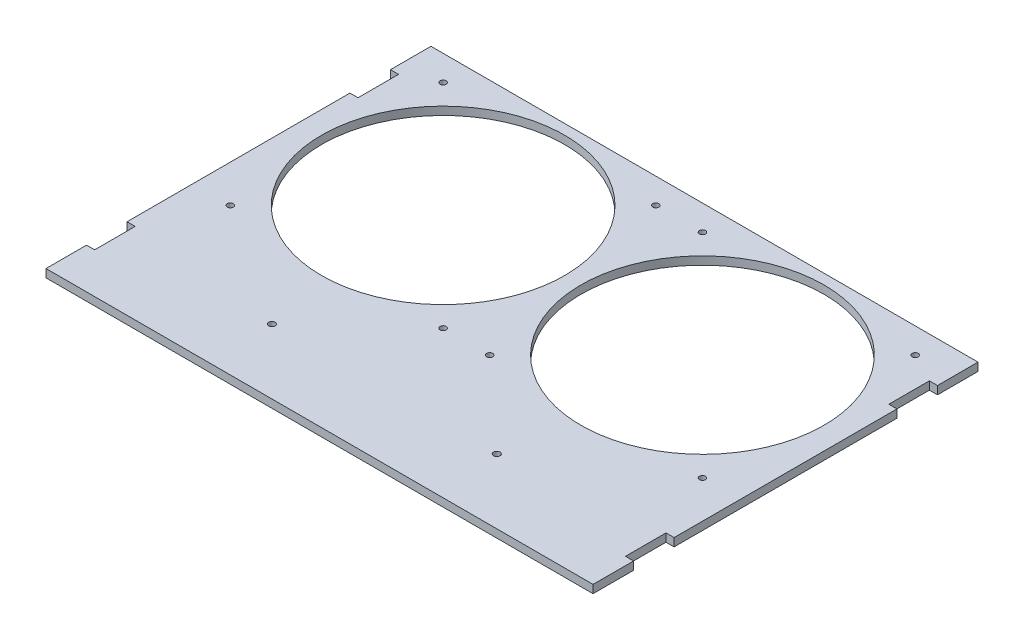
ISO-10303-21;
HEADER;
FILE_DESCRIPTION(('STEP AP214'),'2;1');
FILE_NAME('part.step','',(''),(''),'','','');
FILE_SCHEMA(('AUTOMOTIVE_DESIGN { 1 0 10303 214 1 1 1 1 }'));
ENDSEC;
DATA;
#1=APPLICATION_CONTEXT('core data for automotive mechanical design processes');
#2=APPLICATION_PROTOCOL_DEFINITION('international standard','automotive_design',2000,#1);
#3=PRODUCT_CONTEXT('',#1,'mechanical');
#4=PRODUCT('Part','Part','',(#3));
#5=PRODUCT_RELATED_PRODUCT_CATEGORY('part','',(#4));
#6=PRODUCT_DEFINITION_FORMATION('','',#4);
#7=PRODUCT_DEFINITION_CONTEXT('part definition',#1,'design');
#8=PRODUCT_DEFINITION('design','',#6,#7);
#9=PRODUCT_DEFINITION_SHAPE('','',#8);
#10=(LENGTH_UNIT() NAMED_UNIT(*) SI_UNIT(.MILLI.,.METRE.));
#11=(NAMED_UNIT(*) PLANE_ANGLE_UNIT() SI_UNIT($,.RADIAN.));
#12=(NAMED_UNIT(*) SI_UNIT($,.STERADIAN.) SOLID_ANGLE_UNIT());
#13=UNCERTAINTY_MEASURE_WITH_UNIT(LENGTH_MEASURE(1.E-05),#10,'distance_accuracy_value','');
#14=(GEOMETRIC_REPRESENTATION_CONTEXT(3) GLOBAL_UNCERTAINTY_ASSIGNED_CONTEXT((#13)) GLOBAL_UNIT_ASSIGNED_CONTEXT((#10,
#11,#12)) REPRESENTATION_CONTEXT('',''));
#15=CARTESIAN_POINT('',(0.,0.,0.));
#16=DIRECTION('',(0.,0.,1.));
#17=DIRECTION('',(1.,0.,0.));
#18=AXIS2_PLACEMENT_3D('',#15,#16,#17);
#19=CARTESIAN_POINT('',(0.,4.,0.));
#20=DIRECTION('',(0.,1.,0.));
#21=DIRECTION('',(0.,0.,1.));
#22=AXIS2_PLACEMENT_3D('',#19,#20,#21);
#23=PLANE('',#22);
#24=CARTESIAN_POINT('',(-55.5,4.,93.));
#25=DIRECTION('',(0.,1.,0.));
#26=DIRECTION('',(0.,0.,1.));
#27=AXIS2_PLACEMENT_3D('',#24,#25,#26);
#28=CIRCLE('',#27,1.60000000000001);
#29=CARTESIAN_POINT('',(-55.5,4.,94.6));
#30=VERTEX_POINT('',#29);
#31=EDGE_CURVE('E428',#30,#30,#28,.T.);
#32=ORIENTED_EDGE('',*,*,#31,.F.);
#33=EDGE_LOOP('',(#32));
#34=FACE_BOUND('',#33,.T.);
#35=CARTESIAN_POINT('',(116.5,4.,-52.5));
#36=DIRECTION('',(0.,1.,0.));
#37=DIRECTION('',(0.,0.,-1.));
#38=AXIS2_PLACEMENT_3D('',#35,#36,#37);
#39=CIRCLE('',#38,1.5);
#40=CARTESIAN_POINT('',(116.5,4.,-54.));
#41=VERTEX_POINT('',#40);
#42=EDGE_CURVE('E440',#41,#41,#39,.T.);
#43=ORIENTED_EDGE('',*,*,#42,.F.);
#44=EDGE_LOOP('',(#43));
#45=FACE_BOUND('',#44,.T.);
#46=CARTESIAN_POINT('',(11.5,4.,52.5000000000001));
#47=DIRECTION('',(0.,1.,0.));
#48=DIRECTION('',(0.,0.,-1.));
#49=AXIS2_PLACEMENT_3D('',#46,#47,#48);
#50=CIRCLE('',#49,1.5);
#51=CARTESIAN_POINT('',(11.5,4.,51.0000000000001));
#52=VERTEX_POINT('',#51);
#53=EDGE_CURVE('E452',#52,#52,#50,.T.);
#54=ORIENTED_EDGE('',*,*,#53,.F.);
#55=EDGE_LOOP('',(#54));
#56=FACE_BOUND('',#55,.T.);
#57=CARTESIAN_POINT('',(-11.5,4.,52.5000000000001));
#58=DIRECTION('',(0.,1.,0.));
#59=DIRECTION('',(0.,0.,1.));
#60=AXIS2_PLACEMENT_3D('',#57,#58,#59);
#61=CIRCLE('',#60,1.5);
#62=CARTESIAN_POINT('',(-11.5,4.,54.0000000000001));
#63=VERTEX_POINT('',#62);
#64=EDGE_CURVE('E464',#63,#63,#61,.T.);
#65=ORIENTED_EDGE('',*,*,#64,.F.);
#66=EDGE_LOOP('',(#65));
#67=FACE_BOUND('',#66,.T.);
#68=CARTESIAN_POINT('',(-11.5,4.,-52.5000000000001));
#69=DIRECTION('',(0.,1.,0.));
#70=DIRECTION('',(0.,0.,-1.));
#71=AXIS2_PLACEMENT_3D('',#68,#69,#70);
#72=CIRCLE('',#71,1.5);
#73=CARTESIAN_POINT('',(-11.5,4.,-54.0000000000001));
#74=VERTEX_POINT('',#73);
#75=EDGE_CURVE('E476',#74,#74,#72,.T.);
#76=ORIENTED_EDGE('',*,*,#75,.F.);
#77=EDGE_LOOP('',(#76));
#78=FACE_BOUND('',#77,.T.);
#79=CARTESIAN_POINT('',(-64.,4.,0.));
#80=DIRECTION('',(0.,1.,0.));
#81=DIRECTION('',(0.,0.,1.));
#82=AXIS2_PLACEMENT_3D('',#79,#80,#81);
#83=CIRCLE('',#82,60.);
#84=CARTESIAN_POINT('',(-64.,4.,60.));
#85=VERTEX_POINT('',#84);
#86=EDGE_CURVE('E206',#85,#85,#83,.T.);
#87=ORIENTED_EDGE('',*,*,#86,.F.);
#88=EDGE_LOOP('',(#87));
#89=FACE_BOUND('',#88,.T.);
#90=DIRECTION('',(0.,0.,1.));
#91=VECTOR('',#90,1.);
#92=CARTESIAN_POINT('',(-135.,4.,-65.));
#93=LINE('',#92,#91);
#94=CARTESIAN_POINT('',(-135.,4.,-65.));
#95=VERTEX_POINT('',#94);
#96=CARTESIAN_POINT('',(-135.,4.,-45.));
#97=VERTEX_POINT('',#96);
#98=EDGE_CURVE('E241',#95,#97,#93,.T.);
#99=ORIENTED_EDGE('',*,*,#98,.T.);
#100=DIRECTION('',(1.,0.,0.));
#101=VECTOR('',#100,1.);
#102=CARTESIAN_POINT('',(-135.,4.,-45.));
#103=LINE('',#102,#101);
#104=CARTESIAN_POINT('',(-131.,4.,-45.));
#105=VERTEX_POINT('',#104);
#106=EDGE_CURVE('E129',#97,#105,#103,.T.);
#107=ORIENTED_EDGE('',*,*,#106,.T.);
#108=DIRECTION('',(0.,0.,1.));
#109=VECTOR('',#108,1.);
#110=CARTESIAN_POINT('',(-131.,4.,-45.));
#111=LINE('',#110,#109);
#112=CARTESIAN_POINT('',(-131.,4.,-25.));
#113=VERTEX_POINT('',#112);
#114=EDGE_CURVE('E292',#105,#113,#111,.T.);
#115=ORIENTED_EDGE('',*,*,#114,.T.);
#116=DIRECTION('',(-1.,0.,0.));
#117=VECTOR('',#116,1.);
#118=CARTESIAN_POINT('',(-135.,4.,-25.));
#119=LINE('',#118,#117);
#120=CARTESIAN_POINT('',(-135.,4.,-25.));
#121=VERTEX_POINT('',#120);
#122=EDGE_CURVE('E311',#113,#121,#119,.T.);
#123=ORIENTED_EDGE('',*,*,#122,.T.);
#124=DIRECTION('',(0.,0.,1.));
#125=VECTOR('',#124,1.);
#126=CARTESIAN_POINT('',(-135.,4.,-25.));
#127=LINE('',#126,#125);
#128=CARTESIAN_POINT('',(-135.,4.,85.));
#129=VERTEX_POINT('',#128);
#130=EDGE_CURVE('E308',#121,#129,#127,.T.);
#131=ORIENTED_EDGE('',*,*,#130,.T.);
#132=DIRECTION('',(1.,0.,0.));
#133=VECTOR('',#132,1.);
#134=CARTESIAN_POINT('',(-135.,4.,85.));
#135=LINE('',#134,#133);
#136=CARTESIAN_POINT('',(-131.,4.,85.));
#137=VERTEX_POINT('',#136);
#138=EDGE_CURVE('E310',#129,#137,#135,.T.);
#139=ORIENTED_EDGE('',*,*,#138,.T.);
#140=DIRECTION('',(0.,0.,1.));
#141=VECTOR('',#140,1.);
#142=CARTESIAN_POINT('',(-131.,4.,85.));
#143=LINE('',#142,#141);
#144=CARTESIAN_POINT('',(-131.,4.,105.));
#145=VERTEX_POINT('',#144);
#146=EDGE_CURVE('E313',#137,#145,#143,.T.);
#147=ORIENTED_EDGE('',*,*,#146,.T.);
#148=DIRECTION('',(-1.,0.,0.));
#149=VECTOR('',#148,1.);
#150=CARTESIAN_POINT('',(-135.,4.,105.));
#151=LINE('',#150,#149);
#152=CARTESIAN_POINT('',(-135.,4.,105.));
#153=VERTEX_POINT('',#152);
#154=EDGE_CURVE('E319',#145,#153,#151,.T.);
#155=ORIENTED_EDGE('',*,*,#154,.T.);
#156=DIRECTION('',(0.,0.,1.));
#157=VECTOR('',#156,1.);
#158=CARTESIAN_POINT('',(-135.,4.,105.));
#159=LINE('',#158,#157);
#160=CARTESIAN_POINT('',(-135.,4.,125.));
#161=VERTEX_POINT('',#160);
#162=EDGE_CURVE('E321',#153,#161,#159,.T.);
#163=ORIENTED_EDGE('',*,*,#162,.T.);
#164=DIRECTION('',(1.,0.,0.));
#165=VECTOR('',#164,1.);
#166=CARTESIAN_POINT('',(-135.,4.,125.));
#167=LINE('',#166,#165);
#168=CARTESIAN_POINT('',(135.,4.,125.));
#169=VERTEX_POINT('',#168);
#170=EDGE_CURVE('E323',#161,#169,#167,.T.);
#171=ORIENTED_EDGE('',*,*,#170,.T.);
#172=DIRECTION('',(0.,0.,-1.));
#173=VECTOR('',#172,1.);
#174=CARTESIAN_POINT('',(135.,4.,105.));
#175=LINE('',#174,#173);
#176=CARTESIAN_POINT('',(135.,4.,105.));
#177=VERTEX_POINT('',#176);
#178=EDGE_CURVE('E325',#169,#177,#175,.T.);
#179=ORIENTED_EDGE('',*,*,#178,.T.);
#180=DIRECTION('',(-1.,0.,0.));
#181=VECTOR('',#180,1.);
#182=CARTESIAN_POINT('',(135.,4.,105.));
#183=LINE('',#182,#181);
#184=CARTESIAN_POINT('',(131.,4.,105.));
#185=VERTEX_POINT('',#184);
#186=EDGE_CURVE('E327',#177,#185,#183,.T.);
#187=ORIENTED_EDGE('',*,*,#186,.T.);
#188=DIRECTION('',(0.,0.,-1.));
#189=VECTOR('',#188,1.);
#190=CARTESIAN_POINT('',(131.,4.,85.));
#191=LINE('',#190,#189);
#192=CARTESIAN_POINT('',(131.,4.,85.));
#193=VERTEX_POINT('',#192);
#194=EDGE_CURVE('E329',#185,#193,#191,.T.);
#195=ORIENTED_EDGE('',*,*,#194,.T.);
#196=DIRECTION('',(1.,0.,0.));
#197=VECTOR('',#196,1.);
#198=CARTESIAN_POINT('',(135.,4.,85.));
#199=LINE('',#198,#197);
#200=CARTESIAN_POINT('',(135.,4.,85.));
#201=VERTEX_POINT('',#200);
#202=EDGE_CURVE('E331',#193,#201,#199,.T.);
#203=ORIENTED_EDGE('',*,*,#202,.T.);
#204=DIRECTION('',(0.,0.,-1.));
#205=VECTOR('',#204,1.);
#206=CARTESIAN_POINT('',(135.,4.,-25.));
#207=LINE('',#206,#205);
#208=CARTESIAN_POINT('',(135.,4.,-25.));
#209=VERTEX_POINT('',#208);
#210=EDGE_CURVE('E333',#201,#209,#207,.T.);
#211=ORIENTED_EDGE('',*,*,#210,.T.);
#212=DIRECTION('',(-1.,0.,0.));
#213=VECTOR('',#212,1.);
#214=CARTESIAN_POINT('',(135.,4.,-25.));
#215=LINE('',#214,#213);
#216=CARTESIAN_POINT('',(131.,4.,-25.));
#217=VERTEX_POINT('',#216);
#218=EDGE_CURVE('E335',#209,#217,#215,.T.);
#219=ORIENTED_EDGE('',*,*,#218,.T.);
#220=DIRECTION('',(0.,0.,-1.));
#221=VECTOR('',#220,1.);
#222=CARTESIAN_POINT('',(131.,4.,-45.));
#223=LINE('',#222,#221);
#224=CARTESIAN_POINT('',(131.,4.,-45.));
#225=VERTEX_POINT('',#224);
#226=EDGE_CURVE('E184',#217,#225,#223,.T.);
#227=ORIENTED_EDGE('',*,*,#226,.T.);
#228=DIRECTION('',(1.,0.,0.));
#229=VECTOR('',#228,1.);
#230=CARTESIAN_POINT('',(135.,4.,-45.));
#231=LINE('',#230,#229);
#232=CARTESIAN_POINT('',(135.,4.,-45.));
#233=VERTEX_POINT('',#232);
#234=EDGE_CURVE('E178',#225,#233,#231,.T.);
#235=ORIENTED_EDGE('',*,*,#234,.T.);
#236=DIRECTION('',(0.,0.,-1.));
#237=VECTOR('',#236,1.);
#238=CARTESIAN_POINT('',(135.,4.,-65.));
#239=LINE('',#238,#237);
#240=CARTESIAN_POINT('',(135.,4.,-65.));
#241=VERTEX_POINT('',#240);
#242=EDGE_CURVE('E182',#233,#241,#239,.T.);
#243=ORIENTED_EDGE('',*,*,#242,.T.);
#244=DIRECTION('',(-1.,0.,0.));
#245=VECTOR('',#244,1.);
#246=CARTESIAN_POINT('',(-135.,4.,-65.));
#247=LINE('',#246,#245);
#248=EDGE_CURVE('E50',#241,#95,#247,.T.);
#249=ORIENTED_EDGE('',*,*,#248,.T.);
#250=EDGE_LOOP('',(#99,#107,#115,#123,#131,#139,#147,#155,#163,#171,#179,#187,#195,#203,#211,
#219,#227,#235,#243,#249));
#251=FACE_BOUND('',#250,.T.);
#252=CARTESIAN_POINT('',(-116.5,4.,-52.5));
#253=DIRECTION('',(0.,1.,0.));
#254=DIRECTION('',(0.,0.,1.));
#255=AXIS2_PLACEMENT_3D('',#252,#253,#254);
#256=CIRCLE('',#255,1.5);
#257=CARTESIAN_POINT('',(-116.5,4.,-51.));
#258=VERTEX_POINT('',#257);
#259=EDGE_CURVE('E482',#258,#258,#256,.T.);
#260=ORIENTED_EDGE('',*,*,#259,.F.);
#261=EDGE_LOOP('',(#260));
#262=FACE_BOUND('',#261,.T.);
#263=CARTESIAN_POINT('',(-116.5,4.,52.5));
#264=DIRECTION('',(0.,1.,0.));
#265=DIRECTION('',(0.,0.,-1.));
#266=AXIS2_PLACEMENT_3D('',#263,#264,#265);
#267=CIRCLE('',#266,1.5);
#268=CARTESIAN_POINT('',(-116.5,4.,51.));
#269=VERTEX_POINT('',#268);
#270=EDGE_CURVE('E470',#269,#269,#267,.T.);
#271=ORIENTED_EDGE('',*,*,#270,.F.);
#272=EDGE_LOOP('',(#271));
#273=FACE_BOUND('',#272,.T.);
#274=CARTESIAN_POINT('',(116.5,4.,52.5000000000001));
#275=DIRECTION('',(0.,1.,0.));
#276=DIRECTION('',(0.,0.,1.));
#277=AXIS2_PLACEMENT_3D('',#274,#275,#276);
#278=CIRCLE('',#277,1.5);
#279=CARTESIAN_POINT('',(116.5,4.,54.0000000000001));
#280=VERTEX_POINT('',#279);
#281=EDGE_CURVE('E458',#280,#280,#278,.T.);
#282=ORIENTED_EDGE('',*,*,#281,.F.);
#283=EDGE_LOOP('',(#282));
#284=FACE_BOUND('',#283,.T.);
#285=CARTESIAN_POINT('',(11.5,4.,-52.5000000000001));
#286=DIRECTION('',(0.,1.,0.));
#287=DIRECTION('',(0.,0.,1.));
#288=AXIS2_PLACEMENT_3D('',#285,#286,#287);
#289=CIRCLE('',#288,1.5);
#290=CARTESIAN_POINT('',(11.5,4.,-51.0000000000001));
#291=VERTEX_POINT('',#290);
#292=EDGE_CURVE('E446',#291,#291,#289,.T.);
#293=ORIENTED_EDGE('',*,*,#292,.F.);
#294=EDGE_LOOP('',(#293));
#295=FACE_BOUND('',#294,.T.);
#296=CARTESIAN_POINT('',(64.,4.,0.));
#297=DIRECTION('',(0.,1.,0.));
#298=DIRECTION('',(0.,0.,-1.));
#299=AXIS2_PLACEMENT_3D('',#296,#297,#298);
#300=CIRCLE('',#299,60.);
#301=CARTESIAN_POINT('',(64.,4.,-60.0000000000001));
#302=VERTEX_POINT('',#301);
#303=EDGE_CURVE('E434',#302,#302,#300,.T.);
#304=ORIENTED_EDGE('',*,*,#303,.F.);
#305=EDGE_LOOP('',(#304));
#306=FACE_BOUND('',#305,.T.);
#307=CARTESIAN_POINT('',(55.5,4.,93.));
#308=DIRECTION('',(0.,1.,0.));
#309=DIRECTION('',(0.,0.,-1.));
#310=AXIS2_PLACEMENT_3D('',#307,#308,#309);
#311=CIRCLE('',#310,1.60000000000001);
#312=CARTESIAN_POINT('',(55.5,4.,91.4));
#313=VERTEX_POINT('',#312);
#314=EDGE_CURVE('E419',#313,#313,#311,.T.);
#315=ORIENTED_EDGE('',*,*,#314,.F.);
#316=EDGE_LOOP('',(#315));
#317=FACE_BOUND('',#316,.T.);
#318=ADVANCED_FACE('F33',(#34,#45,#56,#67,#78,#89,#251,#262,#273,#284,#295,#306,#317),#23,.T.);
#319=CARTESIAN_POINT('',(0.,0.,0.));
#320=DIRECTION('',(0.,1.,0.));
#321=DIRECTION('',(0.,0.,1.));
#322=AXIS2_PLACEMENT_3D('',#319,#320,#321);
#323=PLANE('',#322);
#324=CARTESIAN_POINT('',(-55.5,0.,93.));
#325=DIRECTION('',(0.,1.,0.));
#326=DIRECTION('',(0.,0.,1.));
#327=AXIS2_PLACEMENT_3D('',#324,#325,#326);
#328=CIRCLE('',#327,1.60000000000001);
#329=CARTESIAN_POINT('',(-55.5,0.,94.6));
#330=VERTEX_POINT('',#329);
#331=EDGE_CURVE('E425',#330,#330,#328,.T.);
#332=ORIENTED_EDGE('',*,*,#331,.T.);
#333=EDGE_LOOP('',(#332));
#334=FACE_BOUND('',#333,.T.);
#335=CARTESIAN_POINT('',(116.5,0.,-52.5));
#336=DIRECTION('',(0.,1.,0.));
#337=DIRECTION('',(0.,0.,-1.));
#338=AXIS2_PLACEMENT_3D('',#335,#336,#337);
#339=CIRCLE('',#338,1.5);
#340=CARTESIAN_POINT('',(116.5,0.,-54.));
#341=VERTEX_POINT('',#340);
#342=EDGE_CURVE('E437',#341,#341,#339,.T.);
#343=ORIENTED_EDGE('',*,*,#342,.T.);
#344=EDGE_LOOP('',(#343));
#345=FACE_BOUND('',#344,.T.);
#346=CARTESIAN_POINT('',(11.5,0.,52.5000000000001));
#347=DIRECTION('',(0.,1.,0.));
#348=DIRECTION('',(0.,0.,-1.));
#349=AXIS2_PLACEMENT_3D('',#346,#347,#348);
#350=CIRCLE('',#349,1.5);
#351=CARTESIAN_POINT('',(11.5,0.,51.0000000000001));
#352=VERTEX_POINT('',#351);
#353=EDGE_CURVE('E449',#352,#352,#350,.T.);
#354=ORIENTED_EDGE('',*,*,#353,.T.);
#355=EDGE_LOOP('',(#354));
#356=FACE_BOUND('',#355,.T.);
#357=CARTESIAN_POINT('',(-11.5,0.,52.5000000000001));
#358=DIRECTION('',(0.,1.,0.));
#359=DIRECTION('',(0.,0.,1.));
#360=AXIS2_PLACEMENT_3D('',#357,#358,#359);
#361=CIRCLE('',#360,1.5);
#362=CARTESIAN_POINT('',(-11.5,0.,54.0000000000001));
#363=VERTEX_POINT('',#362);
#364=EDGE_CURVE('E461',#363,#363,#361,.T.);
#365=ORIENTED_EDGE('',*,*,#364,.T.);
#366=EDGE_LOOP('',(#365));
#367=FACE_BOUND('',#366,.T.);
#368=CARTESIAN_POINT('',(-11.5,0.,-52.5000000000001));
#369=DIRECTION('',(0.,1.,0.));
#370=DIRECTION('',(0.,0.,-1.));
#371=AXIS2_PLACEMENT_3D('',#368,#369,#370);
#372=CIRCLE('',#371,1.5);
#373=CARTESIAN_POINT('',(-11.5,0.,-54.0000000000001));
#374=VERTEX_POINT('',#373);
#375=EDGE_CURVE('E473',#374,#374,#372,.T.);
#376=ORIENTED_EDGE('',*,*,#375,.T.);
#377=EDGE_LOOP('',(#376));
#378=FACE_BOUND('',#377,.T.);
#379=CARTESIAN_POINT('',(-64.,0.,0.));
#380=DIRECTION('',(0.,1.,0.));
#381=DIRECTION('',(0.,0.,1.));
#382=AXIS2_PLACEMENT_3D('',#379,#380,#381);
#383=CIRCLE('',#382,60.);
#384=CARTESIAN_POINT('',(-64.,0.,60.));
#385=VERTEX_POINT('',#384);
#386=EDGE_CURVE('E485',#385,#385,#383,.T.);
#387=ORIENTED_EDGE('',*,*,#386,.T.);
#388=EDGE_LOOP('',(#387));
#389=FACE_BOUND('',#388,.T.);
#390=DIRECTION('',(0.,0.,1.));
#391=VECTOR('',#390,1.);
#392=CARTESIAN_POINT('',(-135.,0.,-65.));
#393=LINE('',#392,#391);
#394=CARTESIAN_POINT('',(-135.,0.,-65.));
#395=VERTEX_POINT('',#394);
#396=CARTESIAN_POINT('',(-135.,0.,-45.));
#397=VERTEX_POINT('',#396);
#398=EDGE_CURVE('E202',#395,#397,#393,.T.);
#399=ORIENTED_EDGE('',*,*,#398,.F.);
#400=DIRECTION('',(-1.,0.,0.));
#401=VECTOR('',#400,1.);
#402=CARTESIAN_POINT('',(-135.,0.,-65.));
#403=LINE('',#402,#401);
#404=CARTESIAN_POINT('',(135.,0.,-65.));
#405=VERTEX_POINT('',#404);
#406=EDGE_CURVE('E121',#405,#395,#403,.T.);
#407=ORIENTED_EDGE('',*,*,#406,.F.);
#408=DIRECTION('',(0.,0.,-1.));
#409=VECTOR('',#408,1.);
#410=CARTESIAN_POINT('',(135.,0.,-65.));
#411=LINE('',#410,#409);
#412=CARTESIAN_POINT('',(135.,0.,-45.));
#413=VERTEX_POINT('',#412);
#414=EDGE_CURVE('E115',#413,#405,#411,.T.);
#415=ORIENTED_EDGE('',*,*,#414,.F.);
#416=DIRECTION('',(1.,0.,0.));
#417=VECTOR('',#416,1.);
#418=CARTESIAN_POINT('',(135.,0.,-45.));
#419=LINE('',#418,#417);
#420=CARTESIAN_POINT('',(131.,0.,-45.));
#421=VERTEX_POINT('',#420);
#422=EDGE_CURVE('E192',#421,#413,#419,.T.);
#423=ORIENTED_EDGE('',*,*,#422,.F.);
#424=DIRECTION('',(0.,0.,-1.));
#425=VECTOR('',#424,1.);
#426=CARTESIAN_POINT('',(131.,0.,-45.));
#427=LINE('',#426,#425);
#428=CARTESIAN_POINT('',(131.,0.,-25.));
#429=VERTEX_POINT('',#428);
#430=EDGE_CURVE('E236',#429,#421,#427,.T.);
#431=ORIENTED_EDGE('',*,*,#430,.F.);
#432=DIRECTION('',(-1.,0.,0.));
#433=VECTOR('',#432,1.);
#434=CARTESIAN_POINT('',(135.,0.,-25.));
#435=LINE('',#434,#433);
#436=CARTESIAN_POINT('',(135.,0.,-25.));
#437=VERTEX_POINT('',#436);
#438=EDGE_CURVE('E234',#437,#429,#435,.T.);
#439=ORIENTED_EDGE('',*,*,#438,.F.);
#440=DIRECTION('',(0.,0.,-1.));
#441=VECTOR('',#440,1.);
#442=CARTESIAN_POINT('',(135.,0.,-25.));
#443=LINE('',#442,#441);
#444=CARTESIAN_POINT('',(135.,0.,85.));
#445=VERTEX_POINT('',#444);
#446=EDGE_CURVE('E232',#445,#437,#443,.T.);
#447=ORIENTED_EDGE('',*,*,#446,.F.);
#448=DIRECTION('',(1.,0.,0.));
#449=VECTOR('',#448,1.);
#450=CARTESIAN_POINT('',(135.,0.,85.));
#451=LINE('',#450,#449);
#452=CARTESIAN_POINT('',(131.,0.,85.));
#453=VERTEX_POINT('',#452);
#454=EDGE_CURVE('E230',#453,#445,#451,.T.);
#455=ORIENTED_EDGE('',*,*,#454,.F.);
#456=DIRECTION('',(0.,0.,-1.));
#457=VECTOR('',#456,1.);
#458=CARTESIAN_POINT('',(131.,0.,85.));
#459=LINE('',#458,#457);
#460=CARTESIAN_POINT('',(131.,0.,105.));
#461=VERTEX_POINT('',#460);
#462=EDGE_CURVE('E228',#461,#453,#459,.T.);
#463=ORIENTED_EDGE('',*,*,#462,.F.);
#464=DIRECTION('',(-1.,0.,0.));
#465=VECTOR('',#464,1.);
#466=CARTESIAN_POINT('',(135.,0.,105.));
#467=LINE('',#466,#465);
#468=CARTESIAN_POINT('',(135.,0.,105.));
#469=VERTEX_POINT('',#468);
#470=EDGE_CURVE('E226',#469,#461,#467,.T.);
#471=ORIENTED_EDGE('',*,*,#470,.F.);
#472=DIRECTION('',(0.,0.,-1.));
#473=VECTOR('',#472,1.);
#474=CARTESIAN_POINT('',(135.,0.,105.));
#475=LINE('',#474,#473);
#476=CARTESIAN_POINT('',(135.,0.,125.));
#477=VERTEX_POINT('',#476);
#478=EDGE_CURVE('E224',#477,#469,#475,.T.);
#479=ORIENTED_EDGE('',*,*,#478,.F.);
#480=DIRECTION('',(1.,0.,0.));
#481=VECTOR('',#480,1.);
#482=CARTESIAN_POINT('',(-135.,0.,125.));
#483=LINE('',#482,#481);
#484=CARTESIAN_POINT('',(-135.,0.,125.));
#485=VERTEX_POINT('',#484);
#486=EDGE_CURVE('E222',#485,#477,#483,.T.);
#487=ORIENTED_EDGE('',*,*,#486,.F.);
#488=DIRECTION('',(0.,0.,1.));
#489=VECTOR('',#488,1.);
#490=CARTESIAN_POINT('',(-135.,0.,105.));
#491=LINE('',#490,#489);
#492=CARTESIAN_POINT('',(-135.,0.,105.));
#493=VERTEX_POINT('',#492);
#494=EDGE_CURVE('E220',#493,#485,#491,.T.);
#495=ORIENTED_EDGE('',*,*,#494,.F.);
#496=DIRECTION('',(-1.,0.,0.));
#497=VECTOR('',#496,1.);
#498=CARTESIAN_POINT('',(-135.,0.,105.));
#499=LINE('',#498,#497);
#500=CARTESIAN_POINT('',(-131.,0.,105.));
#501=VERTEX_POINT('',#500);
#502=EDGE_CURVE('E218',#501,#493,#499,.T.);
#503=ORIENTED_EDGE('',*,*,#502,.F.);
#504=DIRECTION('',(0.,0.,1.));
#505=VECTOR('',#504,1.);
#506=CARTESIAN_POINT('',(-131.,0.,85.));
#507=LINE('',#506,#505);
#508=CARTESIAN_POINT('',(-131.,0.,85.));
#509=VERTEX_POINT('',#508);
#510=EDGE_CURVE('E216',#509,#501,#507,.T.);
#511=ORIENTED_EDGE('',*,*,#510,.F.);
#512=DIRECTION('',(1.,0.,0.));
#513=VECTOR('',#512,1.);
#514=CARTESIAN_POINT('',(-135.,0.,85.));
#515=LINE('',#514,#513);
#516=CARTESIAN_POINT('',(-135.,0.,85.));
#517=VERTEX_POINT('',#516);
#518=EDGE_CURVE('E214',#517,#509,#515,.T.);
#519=ORIENTED_EDGE('',*,*,#518,.F.);
#520=DIRECTION('',(0.,0.,1.));
#521=VECTOR('',#520,1.);
#522=CARTESIAN_POINT('',(-135.,0.,-25.));
#523=LINE('',#522,#521);
#524=CARTESIAN_POINT('',(-135.,0.,-25.));
#525=VERTEX_POINT('',#524);
#526=EDGE_CURVE('E212',#525,#517,#523,.T.);
#527=ORIENTED_EDGE('',*,*,#526,.F.);
#528=DIRECTION('',(-1.,0.,0.));
#529=VECTOR('',#528,1.);
#530=CARTESIAN_POINT('',(-135.,0.,-25.));
#531=LINE('',#530,#529);
#532=CARTESIAN_POINT('',(-131.,0.,-25.));
#533=VERTEX_POINT('',#532);
#534=EDGE_CURVE('E210',#533,#525,#531,.T.);
#535=ORIENTED_EDGE('',*,*,#534,.F.);
#536=DIRECTION('',(0.,0.,1.));
#537=VECTOR('',#536,1.);
#538=CARTESIAN_POINT('',(-131.,0.,-45.));
#539=LINE('',#538,#537);
#540=CARTESIAN_POINT('',(-131.,0.,-45.));
#541=VERTEX_POINT('',#540);
#542=EDGE_CURVE('E208',#541,#533,#539,.T.);
#543=ORIENTED_EDGE('',*,*,#542,.F.);
#544=DIRECTION('',(1.,0.,0.));
#545=VECTOR('',#544,1.);
#546=CARTESIAN_POINT('',(-135.,0.,-45.));
#547=LINE('',#546,#545);
#548=EDGE_CURVE('E205',#397,#541,#547,.T.);
#549=ORIENTED_EDGE('',*,*,#548,.F.);
#550=EDGE_LOOP('',(#399,#407,#415,#423,#431,#439,#447,#455,#463,#471,#479,#487,#495,#503,#511,
#519,#527,#535,#543,#549));
#551=FACE_BOUND('',#550,.T.);
#552=CARTESIAN_POINT('',(-116.5,0.,-52.5));
#553=DIRECTION('',(0.,1.,0.));
#554=DIRECTION('',(0.,0.,1.));
#555=AXIS2_PLACEMENT_3D('',#552,#553,#554);
#556=CIRCLE('',#555,1.5);
#557=CARTESIAN_POINT('',(-116.5,0.,-51.));
#558=VERTEX_POINT('',#557);
#559=EDGE_CURVE('E479',#558,#558,#556,.T.);
#560=ORIENTED_EDGE('',*,*,#559,.T.);
#561=EDGE_LOOP('',(#560));
#562=FACE_BOUND('',#561,.T.);
#563=CARTESIAN_POINT('',(-116.5,0.,52.5));
#564=DIRECTION('',(0.,1.,0.));
#565=DIRECTION('',(0.,0.,-1.));
#566=AXIS2_PLACEMENT_3D('',#563,#564,#565);
#567=CIRCLE('',#566,1.5);
#568=CARTESIAN_POINT('',(-116.5,0.,51.));
#569=VERTEX_POINT('',#568);
#570=EDGE_CURVE('E467',#569,#569,#567,.T.);
#571=ORIENTED_EDGE('',*,*,#570,.T.);
#572=EDGE_LOOP('',(#571));
#573=FACE_BOUND('',#572,.T.);
#574=CARTESIAN_POINT('',(116.5,0.,52.5000000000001));
#575=DIRECTION('',(0.,1.,0.));
#576=DIRECTION('',(0.,0.,1.));
#577=AXIS2_PLACEMENT_3D('',#574,#575,#576);
#578=CIRCLE('',#577,1.5);
#579=CARTESIAN_POINT('',(116.5,0.,54.0000000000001));
#580=VERTEX_POINT('',#579);
#581=EDGE_CURVE('E455',#580,#580,#578,.T.);
#582=ORIENTED_EDGE('',*,*,#581,.T.);
#583=EDGE_LOOP('',(#582));
#584=FACE_BOUND('',#583,.T.);
#585=CARTESIAN_POINT('',(11.5,0.,-52.5000000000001));
#586=DIRECTION('',(0.,1.,0.));
#587=DIRECTION('',(0.,0.,1.));
#588=AXIS2_PLACEMENT_3D('',#585,#586,#587);
#589=CIRCLE('',#588,1.5);
#590=CARTESIAN_POINT('',(11.5,0.,-51.0000000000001));
#591=VERTEX_POINT('',#590);
#592=EDGE_CURVE('E443',#591,#591,#589,.T.);
#593=ORIENTED_EDGE('',*,*,#592,.T.);
#594=EDGE_LOOP('',(#593));
#595=FACE_BOUND('',#594,.T.);
#596=CARTESIAN_POINT('',(64.,0.,0.));
#597=DIRECTION('',(0.,1.,0.));
#598=DIRECTION('',(0.,0.,-1.));
#599=AXIS2_PLACEMENT_3D('',#596,#597,#598);
#600=CIRCLE('',#599,60.);
#601=CARTESIAN_POINT('',(64.,0.,-60.0000000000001));
#602=VERTEX_POINT('',#601);
#603=EDGE_CURVE('E431',#602,#602,#600,.T.);
#604=ORIENTED_EDGE('',*,*,#603,.T.);
#605=EDGE_LOOP('',(#604));
#606=FACE_BOUND('',#605,.T.);
#607=CARTESIAN_POINT('',(55.5,0.,93.));
#608=DIRECTION('',(0.,1.,0.));
#609=DIRECTION('',(0.,0.,-1.));
#610=AXIS2_PLACEMENT_3D('',#607,#608,#609);
#611=CIRCLE('',#610,1.60000000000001);
#612=CARTESIAN_POINT('',(55.5,0.,91.4));
#613=VERTEX_POINT('',#612);
#614=EDGE_CURVE('E422',#613,#613,#611,.T.);
#615=ORIENTED_EDGE('',*,*,#614,.T.);
#616=EDGE_LOOP('',(#615));
#617=FACE_BOUND('',#616,.T.);
#618=ADVANCED_FACE('F296',(#334,#345,#356,#367,#378,#389,#551,#562,#573,#584,#595,#606,#617),
#323,.F.);
#619=CARTESIAN_POINT('',(-135.,4.,-65.));
#620=DIRECTION('',(1.,0.,0.));
#621=DIRECTION('',(0.,0.,-1.));
#622=AXIS2_PLACEMENT_3D('',#619,#620,#621);
#623=PLANE('',#622);
#624=ORIENTED_EDGE('',*,*,#398,.T.);
#625=DIRECTION('',(0.,-1.,0.));
#626=VECTOR('',#625,1.);
#627=CARTESIAN_POINT('',(-135.,4.,-45.));
#628=LINE('',#627,#626);
#629=EDGE_CURVE('E11',#97,#397,#628,.T.);
#630=ORIENTED_EDGE('',*,*,#629,.F.);
#631=ORIENTED_EDGE('',*,*,#98,.F.);
#632=DIRECTION('',(0.,-1.,0.));
#633=VECTOR('',#632,1.);
#634=CARTESIAN_POINT('',(-135.,4.,-65.));
#635=LINE('',#634,#633);
#636=EDGE_CURVE('E198',#95,#395,#635,.T.);
#637=ORIENTED_EDGE('',*,*,#636,.T.);
#638=EDGE_LOOP('',(#624,#630,#631,#637));
#639=FACE_BOUND('',#638,.T.);
#640=ADVANCED_FACE('F35',(#639),#623,.F.);
#641=CARTESIAN_POINT('',(-135.,4.,-45.));
#642=DIRECTION('',(0.,0.,-1.));
#643=DIRECTION('',(-1.,0.,0.));
#644=AXIS2_PLACEMENT_3D('',#641,#642,#643);
#645=PLANE('',#644);
#646=ORIENTED_EDGE('',*,*,#548,.T.);
#647=DIRECTION('',(0.,-1.,0.));
#648=VECTOR('',#647,1.);
#649=CARTESIAN_POINT('',(-131.,4.,-45.));
#650=LINE('',#649,#648);
#651=EDGE_CURVE('E42',#105,#541,#650,.T.);
#652=ORIENTED_EDGE('',*,*,#651,.F.);
#653=ORIENTED_EDGE('',*,*,#106,.F.);
#654=ORIENTED_EDGE('',*,*,#629,.T.);
#655=EDGE_LOOP('',(#646,#652,#653,#654));
#656=FACE_BOUND('',#655,.T.);
#657=ADVANCED_FACE('F746',(#656),#645,.F.);
#658=CARTESIAN_POINT('',(-131.,4.,-45.));
#659=DIRECTION('',(1.,0.,0.));
#660=DIRECTION('',(0.,0.,-1.));
#661=AXIS2_PLACEMENT_3D('',#658,#659,#660);
#662=PLANE('',#661);
#663=ORIENTED_EDGE('',*,*,#542,.T.);
#664=DIRECTION('',(0.,-1.,0.));
#665=VECTOR('',#664,1.);
#666=CARTESIAN_POINT('',(-131.,4.,-25.));
#667=LINE('',#666,#665);
#668=EDGE_CURVE('E284',#113,#533,#667,.T.);
#669=ORIENTED_EDGE('',*,*,#668,.F.);
#670=ORIENTED_EDGE('',*,*,#114,.F.);
#671=ORIENTED_EDGE('',*,*,#651,.T.);
#672=EDGE_LOOP('',(#663,#669,#670,#671));
#673=FACE_BOUND('',#672,.T.);
#674=ADVANCED_FACE('F290',(#673),#662,.F.);
#675=CARTESIAN_POINT('',(-135.,4.,-25.));
#676=DIRECTION('',(0.,0.,1.));
#677=DIRECTION('',(1.,0.,0.));
#678=AXIS2_PLACEMENT_3D('',#675,#676,#677);
#679=PLANE('',#678);
#680=ORIENTED_EDGE('',*,*,#534,.T.);
#681=DIRECTION('',(0.,-1.,0.));
#682=VECTOR('',#681,1.);
#683=CARTESIAN_POINT('',(-135.,4.,-25.));
#684=LINE('',#683,#682);
#685=EDGE_CURVE('E281',#121,#525,#684,.T.);
#686=ORIENTED_EDGE('',*,*,#685,.F.);
#687=ORIENTED_EDGE('',*,*,#122,.F.);
#688=ORIENTED_EDGE('',*,*,#668,.T.);
#689=EDGE_LOOP('',(#680,#686,#687,#688));
#690=FACE_BOUND('',#689,.T.);
#691=ADVANCED_FACE('F302',(#690),#679,.F.);
#692=CARTESIAN_POINT('',(-135.,4.,-25.));
#693=DIRECTION('',(1.,0.,0.));
#694=DIRECTION('',(0.,0.,-1.));
#695=AXIS2_PLACEMENT_3D('',#692,#693,#694);
#696=PLANE('',#695);
#697=ORIENTED_EDGE('',*,*,#526,.T.);
#698=DIRECTION('',(0.,-1.,0.));
#699=VECTOR('',#698,1.);
#700=CARTESIAN_POINT('',(-135.,4.,85.));
#701=LINE('',#700,#699);
#702=EDGE_CURVE('E278',#129,#517,#701,.T.);
#703=ORIENTED_EDGE('',*,*,#702,.F.);
#704=ORIENTED_EDGE('',*,*,#130,.F.);
#705=ORIENTED_EDGE('',*,*,#685,.T.);
#706=EDGE_LOOP('',(#697,#703,#704,#705));
#707=FACE_BOUND('',#706,.T.);
#708=ADVANCED_FACE('F306',(#707),#696,.F.);
#709=CARTESIAN_POINT('',(-135.,4.,85.));
#710=DIRECTION('',(0.,0.,-1.));
#711=DIRECTION('',(-1.,0.,0.));
#712=AXIS2_PLACEMENT_3D('',#709,#710,#711);
#713=PLANE('',#712);
#714=ORIENTED_EDGE('',*,*,#518,.T.);
#715=DIRECTION('',(0.,-1.,0.));
#716=VECTOR('',#715,1.);
#717=CARTESIAN_POINT('',(-131.,4.,85.));
#718=LINE('',#717,#716);
#719=EDGE_CURVE('E275',#137,#509,#718,.T.);
#720=ORIENTED_EDGE('',*,*,#719,.F.);
#721=ORIENTED_EDGE('',*,*,#138,.F.);
#722=ORIENTED_EDGE('',*,*,#702,.T.);
#723=EDGE_LOOP('',(#714,#720,#721,#722));
#724=FACE_BOUND('',#723,.T.);
#725=ADVANCED_FACE('F711',(#724),#713,.F.);
#726=CARTESIAN_POINT('',(-131.,4.,85.));
#727=DIRECTION('',(1.,0.,0.));
#728=DIRECTION('',(0.,0.,-1.));
#729=AXIS2_PLACEMENT_3D('',#726,#727,#728);
#730=PLANE('',#729);
#731=ORIENTED_EDGE('',*,*,#510,.T.);
#732=DIRECTION('',(0.,-1.,0.));
#733=VECTOR('',#732,1.);
#734=CARTESIAN_POINT('',(-131.,4.,105.));
#735=LINE('',#734,#733);
#736=EDGE_CURVE('E272',#145,#501,#735,.T.);
#737=ORIENTED_EDGE('',*,*,#736,.F.);
#738=ORIENTED_EDGE('',*,*,#146,.F.);
#739=ORIENTED_EDGE('',*,*,#719,.T.);
#740=EDGE_LOOP('',(#731,#737,#738,#739));
#741=FACE_BOUND('',#740,.T.);
#742=ADVANCED_FACE('F701',(#741),#730,.F.);
#743=CARTESIAN_POINT('',(-135.,4.,105.));
#744=DIRECTION('',(0.,0.,1.));
#745=DIRECTION('',(1.,0.,0.));
#746=AXIS2_PLACEMENT_3D('',#743,#744,#745);
#747=PLANE('',#746);
#748=ORIENTED_EDGE('',*,*,#502,.T.);
#749=DIRECTION('',(0.,-1.,0.));
#750=VECTOR('',#749,1.);
#751=CARTESIAN_POINT('',(-135.,4.,105.));
#752=LINE('',#751,#750);
#753=EDGE_CURVE('E269',#153,#493,#752,.T.);
#754=ORIENTED_EDGE('',*,*,#753,.F.);
#755=ORIENTED_EDGE('',*,*,#154,.F.);
#756=ORIENTED_EDGE('',*,*,#736,.T.);
#757=EDGE_LOOP('',(#748,#754,#755,#756));
#758=FACE_BOUND('',#757,.T.);
#759=ADVANCED_FACE('F691',(#758),#747,.F.);
#760=CARTESIAN_POINT('',(-135.,4.,105.));
#761=DIRECTION('',(1.,0.,0.));
#762=DIRECTION('',(0.,0.,-1.));
#763=AXIS2_PLACEMENT_3D('',#760,#761,#762);
#764=PLANE('',#763);
#765=ORIENTED_EDGE('',*,*,#494,.T.);
#766=DIRECTION('',(0.,-1.,0.));
#767=VECTOR('',#766,1.);
#768=CARTESIAN_POINT('',(-135.,4.,125.));
#769=LINE('',#768,#767);
#770=EDGE_CURVE('E266',#161,#485,#769,.T.);
#771=ORIENTED_EDGE('',*,*,#770,.F.);
#772=ORIENTED_EDGE('',*,*,#162,.F.);
#773=ORIENTED_EDGE('',*,*,#753,.T.);
#774=EDGE_LOOP('',(#765,#771,#772,#773));
#775=FACE_BOUND('',#774,.T.);
#776=ADVANCED_FACE('F681',(#775),#764,.F.);
#777=CARTESIAN_POINT('',(-135.,4.,125.));
#778=DIRECTION('',(0.,0.,-1.));
#779=DIRECTION('',(-1.,0.,0.));
#780=AXIS2_PLACEMENT_3D('',#777,#778,#779);
#781=PLANE('',#780);
#782=ORIENTED_EDGE('',*,*,#486,.T.);
#783=DIRECTION('',(0.,-1.,0.));
#784=VECTOR('',#783,1.);
#785=CARTESIAN_POINT('',(135.,4.,125.));
#786=LINE('',#785,#784);
#787=EDGE_CURVE('E263',#169,#477,#786,.T.);
#788=ORIENTED_EDGE('',*,*,#787,.F.);
#789=ORIENTED_EDGE('',*,*,#170,.F.);
#790=ORIENTED_EDGE('',*,*,#770,.T.);
#791=EDGE_LOOP('',(#782,#788,#789,#790));
#792=FACE_BOUND('',#791,.T.);
#793=ADVANCED_FACE('F671',(#792),#781,.F.);
#794=CARTESIAN_POINT('',(135.,4.,105.));
#795=DIRECTION('',(-1.,0.,0.));
#796=DIRECTION('',(0.,0.,1.));
#797=AXIS2_PLACEMENT_3D('',#794,#795,#796);
#798=PLANE('',#797);
#799=ORIENTED_EDGE('',*,*,#478,.T.);
#800=DIRECTION('',(0.,-1.,0.));
#801=VECTOR('',#800,1.);
#802=CARTESIAN_POINT('',(135.,4.,105.));
#803=LINE('',#802,#801);
#804=EDGE_CURVE('E260',#177,#469,#803,.T.);
#805=ORIENTED_EDGE('',*,*,#804,.F.);
#806=ORIENTED_EDGE('',*,*,#178,.F.);
#807=ORIENTED_EDGE('',*,*,#787,.T.);
#808=EDGE_LOOP('',(#799,#805,#806,#807));
#809=FACE_BOUND('',#808,.T.);
#810=ADVANCED_FACE('F661',(#809),#798,.F.);
#811=CARTESIAN_POINT('',(135.,4.,105.));
#812=DIRECTION('',(0.,0.,1.));
#813=DIRECTION('',(1.,0.,0.));
#814=AXIS2_PLACEMENT_3D('',#811,#812,#813);
#815=PLANE('',#814);
#816=ORIENTED_EDGE('',*,*,#470,.T.);
#817=DIRECTION('',(0.,-1.,0.));
#818=VECTOR('',#817,1.);
#819=CARTESIAN_POINT('',(131.,4.,105.));
#820=LINE('',#819,#818);
#821=EDGE_CURVE('E257',#185,#461,#820,.T.);
#822=ORIENTED_EDGE('',*,*,#821,.F.);
#823=ORIENTED_EDGE('',*,*,#186,.F.);
#824=ORIENTED_EDGE('',*,*,#804,.T.);
#825=EDGE_LOOP('',(#816,#822,#823,#824));
#826=FACE_BOUND('',#825,.T.);
#827=ADVANCED_FACE('F651',(#826),#815,.F.);
#828=CARTESIAN_POINT('',(131.,4.,85.));
#829=DIRECTION('',(-1.,0.,0.));
#830=DIRECTION('',(0.,0.,1.));
#831=AXIS2_PLACEMENT_3D('',#828,#829,#830);
#832=PLANE('',#831);
#833=ORIENTED_EDGE('',*,*,#462,.T.);
#834=DIRECTION('',(0.,-1.,0.));
#835=VECTOR('',#834,1.);
#836=CARTESIAN_POINT('',(131.,4.,85.));
#837=LINE('',#836,#835);
#838=EDGE_CURVE('E254',#193,#453,#837,.T.);
#839=ORIENTED_EDGE('',*,*,#838,.F.);
#840=ORIENTED_EDGE('',*,*,#194,.F.);
#841=ORIENTED_EDGE('',*,*,#821,.T.);
#842=EDGE_LOOP('',(#833,#839,#840,#841));
#843=FACE_BOUND('',#842,.T.);
#844=ADVANCED_FACE('F641',(#843),#832,.F.);
#845=CARTESIAN_POINT('',(135.,4.,85.));
#846=DIRECTION('',(0.,0.,-1.));
#847=DIRECTION('',(-1.,0.,0.));
#848=AXIS2_PLACEMENT_3D('',#845,#846,#847);
#849=PLANE('',#848);
#850=ORIENTED_EDGE('',*,*,#454,.T.);
#851=DIRECTION('',(0.,-1.,0.));
#852=VECTOR('',#851,1.);
#853=CARTESIAN_POINT('',(135.,4.,85.));
#854=LINE('',#853,#852);
#855=EDGE_CURVE('E251',#201,#445,#854,.T.);
#856=ORIENTED_EDGE('',*,*,#855,.F.);
#857=ORIENTED_EDGE('',*,*,#202,.F.);
#858=ORIENTED_EDGE('',*,*,#838,.T.);
#859=EDGE_LOOP('',(#850,#856,#857,#858));
#860=FACE_BOUND('',#859,.T.);
#861=ADVANCED_FACE('F631',(#860),#849,.F.);
#862=CARTESIAN_POINT('',(135.,4.,-25.));
#863=DIRECTION('',(-1.,0.,0.));
#864=DIRECTION('',(0.,0.,1.));
#865=AXIS2_PLACEMENT_3D('',#862,#863,#864);
#866=PLANE('',#865);
#867=ORIENTED_EDGE('',*,*,#446,.T.);
#868=DIRECTION('',(0.,-1.,0.));
#869=VECTOR('',#868,1.);
#870=CARTESIAN_POINT('',(135.,4.,-25.));
#871=LINE('',#870,#869);
#872=EDGE_CURVE('E248',#209,#437,#871,.T.);
#873=ORIENTED_EDGE('',*,*,#872,.F.);
#874=ORIENTED_EDGE('',*,*,#210,.F.);
#875=ORIENTED_EDGE('',*,*,#855,.T.);
#876=EDGE_LOOP('',(#867,#873,#874,#875));
#877=FACE_BOUND('',#876,.T.);
#878=ADVANCED_FACE('F622',(#877),#866,.F.);
#879=CARTESIAN_POINT('',(135.,4.,-25.));
#880=DIRECTION('',(0.,0.,1.));
#881=DIRECTION('',(1.,0.,0.));
#882=AXIS2_PLACEMENT_3D('',#879,#880,#881);
#883=PLANE('',#882);
#884=ORIENTED_EDGE('',*,*,#438,.T.);
#885=DIRECTION('',(0.,-1.,0.));
#886=VECTOR('',#885,1.);
#887=CARTESIAN_POINT('',(131.,4.,-25.));
#888=LINE('',#887,#886);
#889=EDGE_CURVE('E245',#217,#429,#888,.T.);
#890=ORIENTED_EDGE('',*,*,#889,.F.);
#891=ORIENTED_EDGE('',*,*,#218,.F.);
#892=ORIENTED_EDGE('',*,*,#872,.T.);
#893=EDGE_LOOP('',(#884,#890,#891,#892));
#894=FACE_BOUND('',#893,.T.);
#895=ADVANCED_FACE('F341',(#894),#883,.F.);
#896=CARTESIAN_POINT('',(131.,4.,-45.));
#897=DIRECTION('',(-1.,0.,0.));
#898=DIRECTION('',(0.,0.,1.));
#899=AXIS2_PLACEMENT_3D('',#896,#897,#898);
#900=PLANE('',#899);
#901=ORIENTED_EDGE('',*,*,#430,.T.);
#902=DIRECTION('',(0.,-1.,0.));
#903=VECTOR('',#902,1.);
#904=CARTESIAN_POINT('',(131.,4.,-45.));
#905=LINE('',#904,#903);
#906=EDGE_CURVE('E193',#225,#421,#905,.T.);
#907=ORIENTED_EDGE('',*,*,#906,.F.);
#908=ORIENTED_EDGE('',*,*,#226,.F.);
#909=ORIENTED_EDGE('',*,*,#889,.T.);
#910=EDGE_LOOP('',(#901,#907,#908,#909));
#911=FACE_BOUND('',#910,.T.);
#912=ADVANCED_FACE('F345',(#911),#900,.F.);
#913=CARTESIAN_POINT('',(135.,4.,-45.));
#914=DIRECTION('',(0.,0.,-1.));
#915=DIRECTION('',(-1.,0.,0.));
#916=AXIS2_PLACEMENT_3D('',#913,#914,#915);
#917=PLANE('',#916);
#918=ORIENTED_EDGE('',*,*,#422,.T.);
#919=DIRECTION('',(0.,-1.,0.));
#920=VECTOR('',#919,1.);
#921=CARTESIAN_POINT('',(135.,4.,-45.));
#922=LINE('',#921,#920);
#923=EDGE_CURVE('E189',#233,#413,#922,.T.);
#924=ORIENTED_EDGE('',*,*,#923,.F.);
#925=ORIENTED_EDGE('',*,*,#234,.F.);
#926=ORIENTED_EDGE('',*,*,#906,.T.);
#927=EDGE_LOOP('',(#918,#924,#925,#926));
#928=FACE_BOUND('',#927,.T.);
#929=ADVANCED_FACE('F190',(#928),#917,.F.);
#930=CARTESIAN_POINT('',(135.,4.,-65.));
#931=DIRECTION('',(-1.,0.,0.));
#932=DIRECTION('',(0.,0.,1.));
#933=AXIS2_PLACEMENT_3D('',#930,#931,#932);
#934=PLANE('',#933);
#935=ORIENTED_EDGE('',*,*,#414,.T.);
#936=DIRECTION('',(0.,-1.,0.));
#937=VECTOR('',#936,1.);
#938=CARTESIAN_POINT('',(135.,4.,-65.));
#939=LINE('',#938,#937);
#940=EDGE_CURVE('E194',#241,#405,#939,.T.);
#941=ORIENTED_EDGE('',*,*,#940,.F.);
#942=ORIENTED_EDGE('',*,*,#242,.F.);
#943=ORIENTED_EDGE('',*,*,#923,.T.);
#944=EDGE_LOOP('',(#935,#941,#942,#943));
#945=FACE_BOUND('',#944,.T.);
#946=ADVANCED_FACE('F196',(#945),#934,.F.);
#947=CARTESIAN_POINT('',(-135.,4.,-65.));
#948=DIRECTION('',(0.,0.,1.));
#949=DIRECTION('',(1.,0.,0.));
#950=AXIS2_PLACEMENT_3D('',#947,#948,#949);
#951=PLANE('',#950);
#952=ORIENTED_EDGE('',*,*,#406,.T.);
#953=ORIENTED_EDGE('',*,*,#636,.F.);
#954=ORIENTED_EDGE('',*,*,#248,.F.);
#955=ORIENTED_EDGE('',*,*,#940,.T.);
#956=EDGE_LOOP('',(#952,#953,#954,#955));
#957=FACE_BOUND('',#956,.T.);
#958=ADVANCED_FACE('F349',(#957),#951,.F.);
#959=CARTESIAN_POINT('',(-64.,4.,0.));
#960=DIRECTION('',(0.,-1.,0.));
#961=DIRECTION('',(0.,0.,-1.));
#962=AXIS2_PLACEMENT_3D('',#959,#960,#961);
#963=CYLINDRICAL_SURFACE('',#962,60.);
#964=ORIENTED_EDGE('',*,*,#86,.T.);
#965=EDGE_LOOP('',(#964));
#966=FACE_BOUND('',#965,.T.);
#967=ORIENTED_EDGE('',*,*,#386,.F.);
#968=EDGE_LOOP('',(#967));
#969=FACE_BOUND('',#968,.T.);
#970=ADVANCED_FACE('F351',(#966,#969),#963,.F.);
#971=CARTESIAN_POINT('',(-116.5,4.,-52.5));
#972=DIRECTION('',(0.,-1.,0.));
#973=DIRECTION('',(0.,0.,-1.));
#974=AXIS2_PLACEMENT_3D('',#971,#972,#973);
#975=CYLINDRICAL_SURFACE('',#974,1.5);
#976=ORIENTED_EDGE('',*,*,#259,.T.);
#977=EDGE_LOOP('',(#976));
#978=FACE_BOUND('',#977,.T.);
#979=ORIENTED_EDGE('',*,*,#559,.F.);
#980=EDGE_LOOP('',(#979));
#981=FACE_BOUND('',#980,.T.);
#982=ADVANCED_FACE('F357',(#978,#981),#975,.F.);
#983=CARTESIAN_POINT('',(-11.5,4.,-52.5000000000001));
#984=DIRECTION('',(0.,-1.,0.));
#985=DIRECTION('',(0.,0.,-1.));
#986=AXIS2_PLACEMENT_3D('',#983,#984,#985);
#987=CYLINDRICAL_SURFACE('',#986,1.5);
#988=ORIENTED_EDGE('',*,*,#75,.T.);
#989=EDGE_LOOP('',(#988));
#990=FACE_BOUND('',#989,.T.);
#991=ORIENTED_EDGE('',*,*,#375,.F.);
#992=EDGE_LOOP('',(#991));
#993=FACE_BOUND('',#992,.T.);
#994=ADVANCED_FACE('F374',(#990,#993),#987,.F.);
#995=CARTESIAN_POINT('',(-116.5,4.,52.5));
#996=DIRECTION('',(0.,-1.,0.));
#997=DIRECTION('',(0.,0.,-1.));
#998=AXIS2_PLACEMENT_3D('',#995,#996,#997);
#999=CYLINDRICAL_SURFACE('',#998,1.5);
#1000=ORIENTED_EDGE('',*,*,#270,.T.);
#1001=EDGE_LOOP('',(#1000));
#1002=FACE_BOUND('',#1001,.T.);
#1003=ORIENTED_EDGE('',*,*,#570,.F.);
#1004=EDGE_LOOP('',(#1003));
#1005=FACE_BOUND('',#1004,.T.);
#1006=ADVANCED_FACE('F378',(#1002,#1005),#999,.F.);
#1007=CARTESIAN_POINT('',(-11.5,4.,52.5000000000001));
#1008=DIRECTION('',(0.,-1.,0.));
#1009=DIRECTION('',(0.,0.,-1.));
#1010=AXIS2_PLACEMENT_3D('',#1007,#1008,#1009);
#1011=CYLINDRICAL_SURFACE('',#1010,1.5);
#1012=ORIENTED_EDGE('',*,*,#64,.T.);
#1013=EDGE_LOOP('',(#1012));
#1014=FACE_BOUND('',#1013,.T.);
#1015=ORIENTED_EDGE('',*,*,#364,.F.);
#1016=EDGE_LOOP('',(#1015));
#1017=FACE_BOUND('',#1016,.T.);
#1018=ADVANCED_FACE('F382',(#1014,#1017),#1011,.F.);
#1019=CARTESIAN_POINT('',(116.5,4.,52.5000000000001));
#1020=DIRECTION('',(0.,-1.,0.));
#1021=DIRECTION('',(0.,0.,-1.));
#1022=AXIS2_PLACEMENT_3D('',#1019,#1020,#1021);
#1023=CYLINDRICAL_SURFACE('',#1022,1.5);
#1024=ORIENTED_EDGE('',*,*,#281,.T.);
#1025=EDGE_LOOP('',(#1024));
#1026=FACE_BOUND('',#1025,.T.);
#1027=ORIENTED_EDGE('',*,*,#581,.F.);
#1028=EDGE_LOOP('',(#1027));
#1029=FACE_BOUND('',#1028,.T.);
#1030=ADVANCED_FACE('F386',(#1026,#1029),#1023,.F.);
#1031=CARTESIAN_POINT('',(11.5,4.,52.5000000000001));
#1032=DIRECTION('',(0.,-1.,0.));
#1033=DIRECTION('',(0.,0.,-1.));
#1034=AXIS2_PLACEMENT_3D('',#1031,#1032,#1033);
#1035=CYLINDRICAL_SURFACE('',#1034,1.5);
#1036=ORIENTED_EDGE('',*,*,#53,.T.);
#1037=EDGE_LOOP('',(#1036));
#1038=FACE_BOUND('',#1037,.T.);
#1039=ORIENTED_EDGE('',*,*,#353,.F.);
#1040=EDGE_LOOP('',(#1039));
#1041=FACE_BOUND('',#1040,.T.);
#1042=ADVANCED_FACE('F390',(#1038,#1041),#1035,.F.);
#1043=CARTESIAN_POINT('',(11.5,4.,-52.5000000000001));
#1044=DIRECTION('',(0.,-1.,0.));
#1045=DIRECTION('',(0.,0.,-1.));
#1046=AXIS2_PLACEMENT_3D('',#1043,#1044,#1045);
#1047=CYLINDRICAL_SURFACE('',#1046,1.5);
#1048=ORIENTED_EDGE('',*,*,#292,.T.);
#1049=EDGE_LOOP('',(#1048));
#1050=FACE_BOUND('',#1049,.T.);
#1051=ORIENTED_EDGE('',*,*,#592,.F.);
#1052=EDGE_LOOP('',(#1051));
#1053=FACE_BOUND('',#1052,.T.);
#1054=ADVANCED_FACE('F394',(#1050,#1053),#1047,.F.);
#1055=CARTESIAN_POINT('',(116.5,4.,-52.5));
#1056=DIRECTION('',(0.,-1.,0.));
#1057=DIRECTION('',(0.,0.,-1.));
#1058=AXIS2_PLACEMENT_3D('',#1055,#1056,#1057);
#1059=CYLINDRICAL_SURFACE('',#1058,1.5);
#1060=ORIENTED_EDGE('',*,*,#42,.T.);
#1061=EDGE_LOOP('',(#1060));
#1062=FACE_BOUND('',#1061,.T.);
#1063=ORIENTED_EDGE('',*,*,#342,.F.);
#1064=EDGE_LOOP('',(#1063));
#1065=FACE_BOUND('',#1064,.T.);
#1066=ADVANCED_FACE('F398',(#1062,#1065),#1059,.F.);
#1067=CARTESIAN_POINT('',(64.,4.,0.));
#1068=DIRECTION('',(0.,-1.,0.));
#1069=DIRECTION('',(0.,0.,-1.));
#1070=AXIS2_PLACEMENT_3D('',#1067,#1068,#1069);
#1071=CYLINDRICAL_SURFACE('',#1070,60.);
#1072=ORIENTED_EDGE('',*,*,#303,.T.);
#1073=EDGE_LOOP('',(#1072));
#1074=FACE_BOUND('',#1073,.T.);
#1075=ORIENTED_EDGE('',*,*,#603,.F.);
#1076=EDGE_LOOP('',(#1075));
#1077=FACE_BOUND('',#1076,.T.);
#1078=ADVANCED_FACE('F402',(#1074,#1077),#1071,.F.);
#1079=CARTESIAN_POINT('',(-55.5,4.,93.));
#1080=DIRECTION('',(0.,-1.,0.));
#1081=DIRECTION('',(0.,0.,-1.));
#1082=AXIS2_PLACEMENT_3D('',#1079,#1080,#1081);
#1083=CYLINDRICAL_SURFACE('',#1082,1.60000000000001);
#1084=ORIENTED_EDGE('',*,*,#31,.T.);
#1085=EDGE_LOOP('',(#1084));
#1086=FACE_BOUND('',#1085,.T.);
#1087=ORIENTED_EDGE('',*,*,#331,.F.);
#1088=EDGE_LOOP('',(#1087));
#1089=FACE_BOUND('',#1088,.T.);
#1090=ADVANCED_FACE('F406',(#1086,#1089),#1083,.F.);
#1091=CARTESIAN_POINT('',(55.5,4.,93.));
#1092=DIRECTION('',(0.,-1.,0.));
#1093=DIRECTION('',(0.,0.,-1.));
#1094=AXIS2_PLACEMENT_3D('',#1091,#1092,#1093);
#1095=CYLINDRICAL_SURFACE('',#1094,1.60000000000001);
#1096=ORIENTED_EDGE('',*,*,#314,.T.);
#1097=EDGE_LOOP('',(#1096));
#1098=FACE_BOUND('',#1097,.T.);
#1099=ORIENTED_EDGE('',*,*,#614,.F.);
#1100=EDGE_LOOP('',(#1099));
#1101=FACE_BOUND('',#1100,.T.);
#1102=ADVANCED_FACE('F410',(#1098,#1101),#1095,.F.);
#1103=CLOSED_SHELL('',(#318,#618,#640,#657,#674,#691,#708,#725,#742,#759,#776,#793,#810,#827,
#844,#861,#878,#895,#912,#929,#946,#958,#970,#982,#994,#1006,#1018,#1030,#1042,#1054,#1066,
#1078,#1090,#1102));
#1104=MANIFOLD_SOLID_BREP('B2',#1103);
#1105=ADVANCED_BREP_SHAPE_REPRESENTATION('',(#18,#1104),#14);
#1106=SHAPE_DEFINITION_REPRESENTATION(#9,#1105);
ENDSEC;
END-ISO-10303-21;
